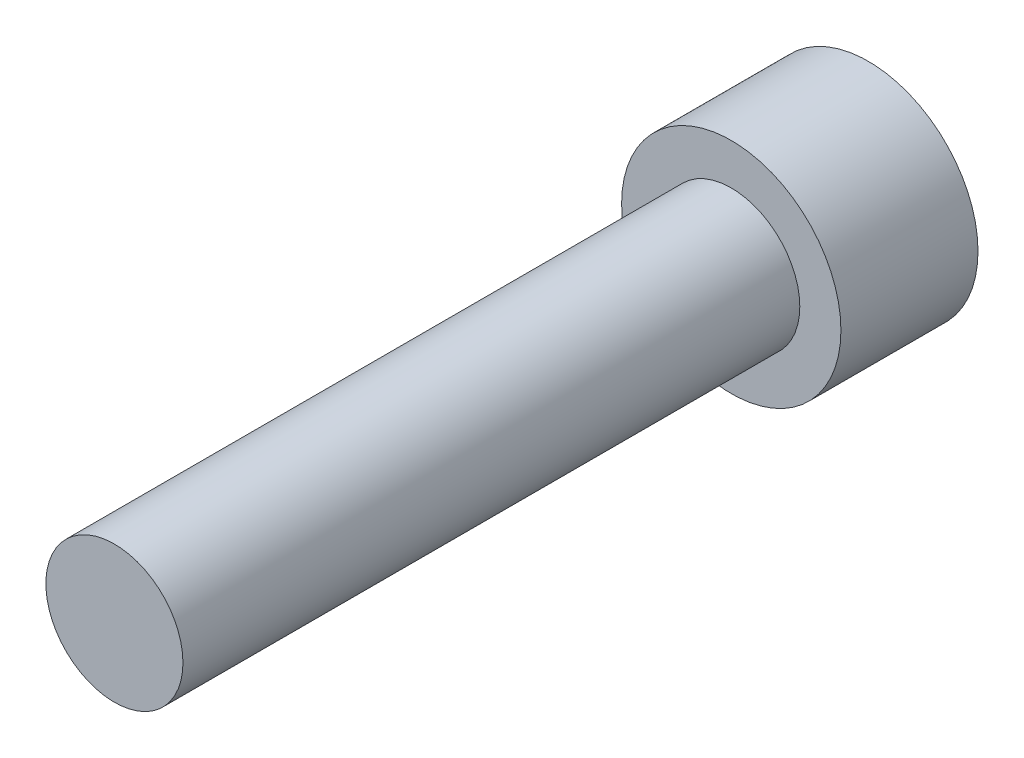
ISO-10303-21;
HEADER;
FILE_DESCRIPTION(('STEP AP214'),'2;1');
FILE_NAME('part.step','',(''),(''),'','','');
FILE_SCHEMA(('AUTOMOTIVE_DESIGN { 1 0 10303 214 1 1 1 1 }'));
ENDSEC;
DATA;
#1=APPLICATION_CONTEXT('core data for automotive mechanical design processes');
#2=APPLICATION_PROTOCOL_DEFINITION('international standard','automotive_design',2000,#1);
#3=PRODUCT_CONTEXT('',#1,'mechanical');
#4=PRODUCT('Part','Part','',(#3));
#5=PRODUCT_RELATED_PRODUCT_CATEGORY('part','',(#4));
#6=PRODUCT_DEFINITION_FORMATION('','',#4);
#7=PRODUCT_DEFINITION_CONTEXT('part definition',#1,'design');
#8=PRODUCT_DEFINITION('design','',#6,#7);
#9=PRODUCT_DEFINITION_SHAPE('','',#8);
#10=(LENGTH_UNIT() NAMED_UNIT(*) SI_UNIT(.MILLI.,.METRE.));
#11=(NAMED_UNIT(*) PLANE_ANGLE_UNIT() SI_UNIT($,.RADIAN.));
#12=(NAMED_UNIT(*) SI_UNIT($,.STERADIAN.) SOLID_ANGLE_UNIT());
#13=UNCERTAINTY_MEASURE_WITH_UNIT(LENGTH_MEASURE(1.E-05),#10,'distance_accuracy_value','');
#14=(GEOMETRIC_REPRESENTATION_CONTEXT(3) GLOBAL_UNCERTAINTY_ASSIGNED_CONTEXT((#13)) GLOBAL_UNIT_ASSIGNED_CONTEXT((#10,
#11,#12)) REPRESENTATION_CONTEXT('',''));
#15=CARTESIAN_POINT('',(0.,0.,0.));
#16=DIRECTION('',(0.,0.,1.));
#17=DIRECTION('',(1.,0.,0.));
#18=AXIS2_PLACEMENT_3D('',#15,#16,#17);
#19=CARTESIAN_POINT('',(0.,0.,45.));
#20=DIRECTION('',(0.,0.,1.));
#21=DIRECTION('',(1.,0.,0.));
#22=AXIS2_PLACEMENT_3D('',#19,#20,#21);
#23=PLANE('',#22);
#24=CARTESIAN_POINT('',(0.,0.,45.));
#25=DIRECTION('',(0.,0.,1.));
#26=DIRECTION('',(1.,0.,0.));
#27=AXIS2_PLACEMENT_3D('',#24,#25,#26);
#28=CIRCLE('',#27,5.);
#29=CARTESIAN_POINT('',(5.,0.,45.));
#30=VERTEX_POINT('',#29);
#31=EDGE_CURVE('E11',#30,#30,#28,.T.);
#32=ORIENTED_EDGE('',*,*,#31,.T.);
#33=EDGE_LOOP('',(#32));
#34=FACE_BOUND('',#33,.T.);
#35=ADVANCED_FACE('F32',(#34),#23,.T.);
#36=CARTESIAN_POINT('',(0.,0.,45.));
#37=DIRECTION('',(0.,0.,1.));
#38=DIRECTION('',(1.,0.,0.));
#39=AXIS2_PLACEMENT_3D('',#36,#37,#38);
#40=CYLINDRICAL_SURFACE('',#39,5.);
#41=CARTESIAN_POINT('',(0.,0.,0.));
#42=DIRECTION('',(0.,0.,1.));
#43=DIRECTION('',(1.,0.,0.));
#44=AXIS2_PLACEMENT_3D('',#41,#42,#43);
#45=CIRCLE('',#44,5.);
#46=CARTESIAN_POINT('',(5.,0.,0.));
#47=VERTEX_POINT('',#46);
#48=EDGE_CURVE('E39',#47,#47,#45,.T.);
#49=ORIENTED_EDGE('',*,*,#48,.T.);
#50=EDGE_LOOP('',(#49));
#51=FACE_BOUND('',#50,.T.);
#52=ORIENTED_EDGE('',*,*,#31,.F.);
#53=EDGE_LOOP('',(#52));
#54=FACE_BOUND('',#53,.T.);
#55=ADVANCED_FACE('F146',(#51,#54),#40,.T.);
#56=CARTESIAN_POINT('',(0.,-5.,0.));
#57=DIRECTION('',(0.,0.,1.));
#58=DIRECTION('',(1.,0.,0.));
#59=AXIS2_PLACEMENT_3D('',#56,#57,#58);
#60=PLANE('',#59);
#61=CARTESIAN_POINT('',(0.,0.,0.));
#62=DIRECTION('',(0.,0.,1.));
#63=DIRECTION('',(1.,0.,0.));
#64=AXIS2_PLACEMENT_3D('',#61,#62,#63);
#65=CIRCLE('',#64,8.);
#66=CARTESIAN_POINT('',(8.,0.,0.));
#67=VERTEX_POINT('',#66);
#68=EDGE_CURVE('E141',#67,#67,#65,.T.);
#69=ORIENTED_EDGE('',*,*,#68,.T.);
#70=EDGE_LOOP('',(#69));
#71=FACE_BOUND('',#70,.T.);
#72=ORIENTED_EDGE('',*,*,#48,.F.);
#73=EDGE_LOOP('',(#72));
#74=FACE_BOUND('',#73,.T.);
#75=ADVANCED_FACE('F149',(#71,#74),#60,.T.);
#76=CARTESIAN_POINT('',(0.,0.,45.));
#77=DIRECTION('',(0.,0.,1.));
#78=DIRECTION('',(1.,0.,0.));
#79=AXIS2_PLACEMENT_3D('',#76,#77,#78);
#80=CYLINDRICAL_SURFACE('',#79,8.);
#81=CARTESIAN_POINT('',(0.,0.,-9.99999999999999));
#82=DIRECTION('',(0.,0.,1.));
#83=DIRECTION('',(1.,0.,0.));
#84=AXIS2_PLACEMENT_3D('',#81,#82,#83);
#85=CIRCLE('',#84,8.);
#86=CARTESIAN_POINT('',(8.,0.,-9.99999999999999));
#87=VERTEX_POINT('',#86);
#88=EDGE_CURVE('E133',#87,#87,#85,.T.);
#89=ORIENTED_EDGE('',*,*,#88,.T.);
#90=EDGE_LOOP('',(#89));
#91=FACE_BOUND('',#90,.T.);
#92=ORIENTED_EDGE('',*,*,#68,.F.);
#93=EDGE_LOOP('',(#92));
#94=FACE_BOUND('',#93,.T.);
#95=ADVANCED_FACE('F151',(#91,#94),#80,.T.);
#96=CARTESIAN_POINT('',(0.,-8.,-10.));
#97=DIRECTION('',(0.,0.,-1.));
#98=DIRECTION('',(-1.,0.,0.));
#99=AXIS2_PLACEMENT_3D('',#96,#97,#98);
#100=PLANE('',#99);
#101=DIRECTION('',(0.866025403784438,-0.5,0.));
#102=VECTOR('',#101,1.);
#103=CARTESIAN_POINT('',(0.,4.61880215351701,-10.));
#104=LINE('',#103,#102);
#105=CARTESIAN_POINT('',(0.,4.61880215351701,-10.));
#106=VERTEX_POINT('',#105);
#107=CARTESIAN_POINT('',(4.,2.3094010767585,-10.));
#108=VERTEX_POINT('',#107);
#109=EDGE_CURVE('E46',#106,#108,#104,.T.);
#110=ORIENTED_EDGE('',*,*,#109,.F.);
#111=DIRECTION('',(0.866025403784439,0.5,0.));
#112=VECTOR('',#111,1.);
#113=CARTESIAN_POINT('',(-4.,2.3094010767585,-10.));
#114=LINE('',#113,#112);
#115=CARTESIAN_POINT('',(-4.,2.3094010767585,-10.));
#116=VERTEX_POINT('',#115);
#117=EDGE_CURVE('E129',#116,#106,#114,.T.);
#118=ORIENTED_EDGE('',*,*,#117,.F.);
#119=DIRECTION('',(0.,1.,0.));
#120=VECTOR('',#119,1.);
#121=CARTESIAN_POINT('',(-4.,-2.3094010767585,-10.));
#122=LINE('',#121,#120);
#123=CARTESIAN_POINT('',(-4.,-2.3094010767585,-10.));
#124=VERTEX_POINT('',#123);
#125=EDGE_CURVE('E127',#124,#116,#122,.T.);
#126=ORIENTED_EDGE('',*,*,#125,.F.);
#127=DIRECTION('',(-0.866025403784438,0.5,0.));
#128=VECTOR('',#127,1.);
#129=CARTESIAN_POINT('',(0.,-4.61880215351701,-10.));
#130=LINE('',#129,#128);
#131=CARTESIAN_POINT('',(0.,-4.61880215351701,-10.));
#132=VERTEX_POINT('',#131);
#133=EDGE_CURVE('E94',#132,#124,#130,.T.);
#134=ORIENTED_EDGE('',*,*,#133,.F.);
#135=DIRECTION('',(-0.866025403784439,-0.5,0.));
#136=VECTOR('',#135,1.);
#137=CARTESIAN_POINT('',(4.,-2.3094010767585,-10.));
#138=LINE('',#137,#136);
#139=CARTESIAN_POINT('',(4.,-2.3094010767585,-10.));
#140=VERTEX_POINT('',#139);
#141=EDGE_CURVE('E123',#140,#132,#138,.T.);
#142=ORIENTED_EDGE('',*,*,#141,.F.);
#143=DIRECTION('',(0.,-1.,0.));
#144=VECTOR('',#143,1.);
#145=CARTESIAN_POINT('',(4.,2.3094010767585,-10.));
#146=LINE('',#145,#144);
#147=EDGE_CURVE('E120',#108,#140,#146,.T.);
#148=ORIENTED_EDGE('',*,*,#147,.F.);
#149=EDGE_LOOP('',(#110,#118,#126,#134,#142,#148));
#150=FACE_BOUND('',#149,.T.);
#151=ORIENTED_EDGE('',*,*,#88,.F.);
#152=EDGE_LOOP('',(#151));
#153=FACE_BOUND('',#152,.T.);
#154=ADVANCED_FACE('F158',(#150,#153),#100,.T.);
#155=CARTESIAN_POINT('',(0.,4.61880215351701,-2.));
#156=DIRECTION('',(0.5,0.866025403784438,0.));
#157=DIRECTION('',(-0.866025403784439,0.5,0.));
#158=AXIS2_PLACEMENT_3D('',#155,#156,#157);
#159=PLANE('',#158);
#160=ORIENTED_EDGE('',*,*,#109,.T.);
#161=DIRECTION('',(0.,0.,-1.));
#162=VECTOR('',#161,1.);
#163=CARTESIAN_POINT('',(4.,2.3094010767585,-2.));
#164=LINE('',#163,#162);
#165=CARTESIAN_POINT('',(4.,2.3094010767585,-2.));
#166=VERTEX_POINT('',#165);
#167=EDGE_CURVE('E76',#166,#108,#164,.T.);
#168=ORIENTED_EDGE('',*,*,#167,.F.);
#169=DIRECTION('',(0.866025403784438,-0.5,0.));
#170=VECTOR('',#169,1.);
#171=CARTESIAN_POINT('',(0.,4.61880215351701,-2.));
#172=LINE('',#171,#170);
#173=CARTESIAN_POINT('',(0.,4.61880215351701,-2.));
#174=VERTEX_POINT('',#173);
#175=EDGE_CURVE('E131',#174,#166,#172,.T.);
#176=ORIENTED_EDGE('',*,*,#175,.F.);
#177=DIRECTION('',(0.,0.,-1.));
#178=VECTOR('',#177,1.);
#179=CARTESIAN_POINT('',(0.,4.61880215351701,-2.));
#180=LINE('',#179,#178);
#181=EDGE_CURVE('E54',#174,#106,#180,.T.);
#182=ORIENTED_EDGE('',*,*,#181,.T.);
#183=EDGE_LOOP('',(#160,#168,#176,#182));
#184=FACE_BOUND('',#183,.T.);
#185=ADVANCED_FACE('F189',(#184),#159,.F.);
#186=CARTESIAN_POINT('',(-4.,2.3094010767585,-2.));
#187=DIRECTION('',(-0.5,0.866025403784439,0.));
#188=DIRECTION('',(-0.866025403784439,-0.5,0.));
#189=AXIS2_PLACEMENT_3D('',#186,#187,#188);
#190=PLANE('',#189);
#191=ORIENTED_EDGE('',*,*,#117,.T.);
#192=ORIENTED_EDGE('',*,*,#181,.F.);
#193=DIRECTION('',(0.866025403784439,0.5,0.));
#194=VECTOR('',#193,1.);
#195=CARTESIAN_POINT('',(-4.,2.3094010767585,-2.));
#196=LINE('',#195,#194);
#197=CARTESIAN_POINT('',(-4.,2.3094010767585,-2.));
#198=VERTEX_POINT('',#197);
#199=EDGE_CURVE('E106',#198,#174,#196,.T.);
#200=ORIENTED_EDGE('',*,*,#199,.F.);
#201=DIRECTION('',(0.,0.,-1.));
#202=VECTOR('',#201,1.);
#203=CARTESIAN_POINT('',(-4.,2.3094010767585,-2.));
#204=LINE('',#203,#202);
#205=EDGE_CURVE('E98',#198,#116,#204,.T.);
#206=ORIENTED_EDGE('',*,*,#205,.T.);
#207=EDGE_LOOP('',(#191,#192,#200,#206));
#208=FACE_BOUND('',#207,.T.);
#209=ADVANCED_FACE('F199',(#208),#190,.F.);
#210=CARTESIAN_POINT('',(-4.,-2.3094010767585,-2.));
#211=DIRECTION('',(-1.,0.,0.));
#212=DIRECTION('',(0.,0.,1.));
#213=AXIS2_PLACEMENT_3D('',#210,#211,#212);
#214=PLANE('',#213);
#215=ORIENTED_EDGE('',*,*,#125,.T.);
#216=ORIENTED_EDGE('',*,*,#205,.F.);
#217=DIRECTION('',(0.,1.,0.));
#218=VECTOR('',#217,1.);
#219=CARTESIAN_POINT('',(-4.,-2.3094010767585,-2.));
#220=LINE('',#219,#218);
#221=CARTESIAN_POINT('',(-4.,-2.3094010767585,-2.));
#222=VERTEX_POINT('',#221);
#223=EDGE_CURVE('E102',#222,#198,#220,.T.);
#224=ORIENTED_EDGE('',*,*,#223,.F.);
#225=DIRECTION('',(0.,0.,-1.));
#226=VECTOR('',#225,1.);
#227=CARTESIAN_POINT('',(-4.,-2.3094010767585,-2.));
#228=LINE('',#227,#226);
#229=EDGE_CURVE('E87',#222,#124,#228,.T.);
#230=ORIENTED_EDGE('',*,*,#229,.T.);
#231=EDGE_LOOP('',(#215,#216,#224,#230));
#232=FACE_BOUND('',#231,.T.);
#233=ADVANCED_FACE('F103',(#232),#214,.F.);
#234=CARTESIAN_POINT('',(0.,-4.61880215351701,-2.));
#235=DIRECTION('',(-0.5,-0.866025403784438,0.));
#236=DIRECTION('',(0.866025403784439,-0.5,0.));
#237=AXIS2_PLACEMENT_3D('',#234,#235,#236);
#238=PLANE('',#237);
#239=ORIENTED_EDGE('',*,*,#133,.T.);
#240=ORIENTED_EDGE('',*,*,#229,.F.);
#241=DIRECTION('',(-0.866025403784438,0.5,0.));
#242=VECTOR('',#241,1.);
#243=CARTESIAN_POINT('',(0.,-4.61880215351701,-2.));
#244=LINE('',#243,#242);
#245=CARTESIAN_POINT('',(0.,-4.61880215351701,-2.));
#246=VERTEX_POINT('',#245);
#247=EDGE_CURVE('E91',#246,#222,#244,.T.);
#248=ORIENTED_EDGE('',*,*,#247,.F.);
#249=DIRECTION('',(0.,0.,-1.));
#250=VECTOR('',#249,1.);
#251=CARTESIAN_POINT('',(0.,-4.61880215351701,-2.));
#252=LINE('',#251,#250);
#253=EDGE_CURVE('E99',#246,#132,#252,.T.);
#254=ORIENTED_EDGE('',*,*,#253,.T.);
#255=EDGE_LOOP('',(#239,#240,#248,#254));
#256=FACE_BOUND('',#255,.T.);
#257=ADVANCED_FACE('F89',(#256),#238,.F.);
#258=CARTESIAN_POINT('',(4.,-2.3094010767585,-2.));
#259=DIRECTION('',(0.5,-0.866025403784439,0.));
#260=DIRECTION('',(0.866025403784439,0.5,0.));
#261=AXIS2_PLACEMENT_3D('',#258,#259,#260);
#262=PLANE('',#261);
#263=ORIENTED_EDGE('',*,*,#141,.T.);
#264=ORIENTED_EDGE('',*,*,#253,.F.);
#265=DIRECTION('',(-0.866025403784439,-0.5,0.));
#266=VECTOR('',#265,1.);
#267=CARTESIAN_POINT('',(4.,-2.3094010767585,-2.));
#268=LINE('',#267,#266);
#269=CARTESIAN_POINT('',(4.,-2.3094010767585,-2.));
#270=VERTEX_POINT('',#269);
#271=EDGE_CURVE('E112',#270,#246,#268,.T.);
#272=ORIENTED_EDGE('',*,*,#271,.F.);
#273=DIRECTION('',(0.,0.,-1.));
#274=VECTOR('',#273,1.);
#275=CARTESIAN_POINT('',(4.,-2.3094010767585,-2.));
#276=LINE('',#275,#274);
#277=EDGE_CURVE('E136',#270,#140,#276,.T.);
#278=ORIENTED_EDGE('',*,*,#277,.T.);
#279=EDGE_LOOP('',(#263,#264,#272,#278));
#280=FACE_BOUND('',#279,.T.);
#281=ADVANCED_FACE('F224',(#280),#262,.F.);
#282=CARTESIAN_POINT('',(4.,2.3094010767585,-2.));
#283=DIRECTION('',(1.,0.,0.));
#284=DIRECTION('',(0.,0.,-1.));
#285=AXIS2_PLACEMENT_3D('',#282,#283,#284);
#286=PLANE('',#285);
#287=ORIENTED_EDGE('',*,*,#147,.T.);
#288=ORIENTED_EDGE('',*,*,#277,.F.);
#289=DIRECTION('',(0.,-1.,0.));
#290=VECTOR('',#289,1.);
#291=CARTESIAN_POINT('',(4.,2.3094010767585,-2.));
#292=LINE('',#291,#290);
#293=EDGE_CURVE('E114',#166,#270,#292,.T.);
#294=ORIENTED_EDGE('',*,*,#293,.F.);
#295=ORIENTED_EDGE('',*,*,#167,.T.);
#296=EDGE_LOOP('',(#287,#288,#294,#295));
#297=FACE_BOUND('',#296,.T.);
#298=ADVANCED_FACE('F233',(#297),#286,.F.);
#299=CARTESIAN_POINT('',(8.,0.,-2.));
#300=DIRECTION('',(0.,0.,-1.));
#301=DIRECTION('',(-1.,0.,0.));
#302=AXIS2_PLACEMENT_3D('',#299,#300,#301);
#303=PLANE('',#302);
#304=ORIENTED_EDGE('',*,*,#175,.T.);
#305=ORIENTED_EDGE('',*,*,#293,.T.);
#306=ORIENTED_EDGE('',*,*,#271,.T.);
#307=ORIENTED_EDGE('',*,*,#247,.T.);
#308=ORIENTED_EDGE('',*,*,#223,.T.);
#309=ORIENTED_EDGE('',*,*,#199,.T.);
#310=EDGE_LOOP('',(#304,#305,#306,#307,#308,#309));
#311=FACE_BOUND('',#310,.T.);
#312=ADVANCED_FACE('F109',(#311),#303,.T.);
#313=CLOSED_SHELL('',(#35,#55,#75,#95,#154,#185,#209,#233,#257,#281,#298,#312));
#314=MANIFOLD_SOLID_BREP('B2',#313);
#315=ADVANCED_BREP_SHAPE_REPRESENTATION('',(#18,#314),#14);
#316=SHAPE_DEFINITION_REPRESENTATION(#9,#315);
ENDSEC;
END-ISO-10303-21;
